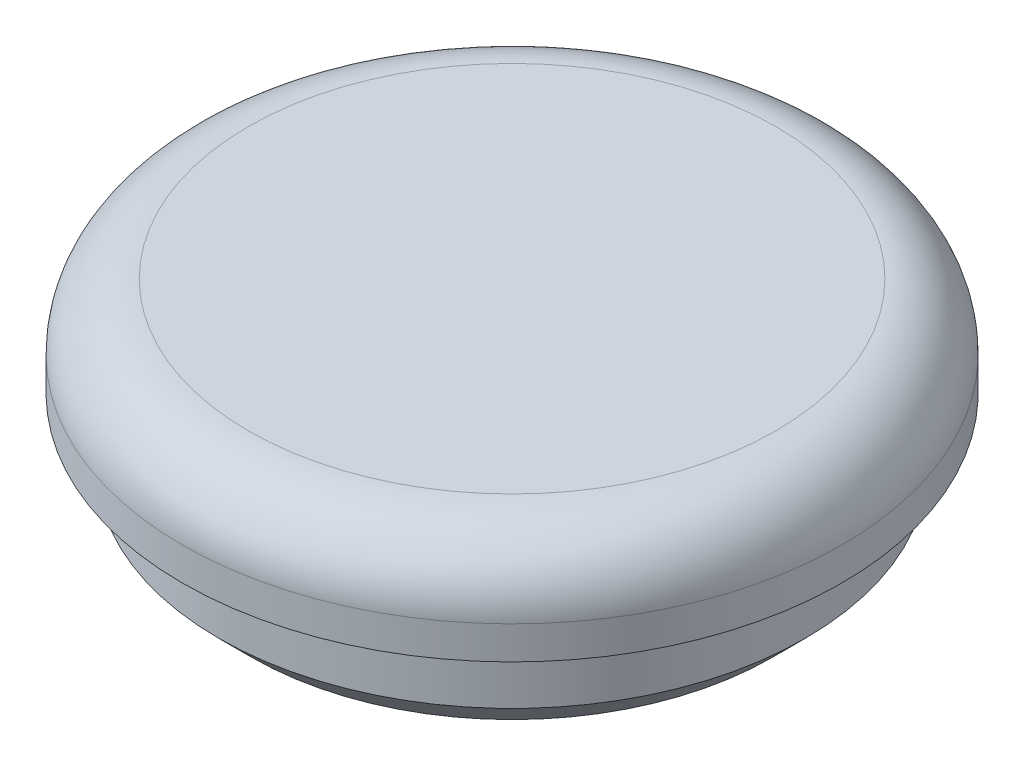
ISO-10303-21;
HEADER;
FILE_DESCRIPTION(('STEP AP214'),'2;1');
FILE_NAME('part.step','',(''),(''),'','','');
FILE_SCHEMA(('AUTOMOTIVE_DESIGN { 1 0 10303 214 1 1 1 1 }'));
ENDSEC;
DATA;
#1=APPLICATION_CONTEXT('core data for automotive mechanical design processes');
#2=APPLICATION_PROTOCOL_DEFINITION('international standard','automotive_design',2000,#1);
#3=PRODUCT_CONTEXT('',#1,'mechanical');
#4=PRODUCT('Part','Part','',(#3));
#5=PRODUCT_RELATED_PRODUCT_CATEGORY('part','',(#4));
#6=PRODUCT_DEFINITION_FORMATION('','',#4);
#7=PRODUCT_DEFINITION_CONTEXT('part definition',#1,'design');
#8=PRODUCT_DEFINITION('design','',#6,#7);
#9=PRODUCT_DEFINITION_SHAPE('','',#8);
#10=(LENGTH_UNIT() NAMED_UNIT(*) SI_UNIT(.MILLI.,.METRE.));
#11=(NAMED_UNIT(*) PLANE_ANGLE_UNIT() SI_UNIT($,.RADIAN.));
#12=(NAMED_UNIT(*) SI_UNIT($,.STERADIAN.) SOLID_ANGLE_UNIT());
#13=UNCERTAINTY_MEASURE_WITH_UNIT(LENGTH_MEASURE(1.E-05),#10,'distance_accuracy_value','');
#14=(GEOMETRIC_REPRESENTATION_CONTEXT(3) GLOBAL_UNCERTAINTY_ASSIGNED_CONTEXT((#13)) GLOBAL_UNIT_ASSIGNED_CONTEXT((#10,
#11,#12)) REPRESENTATION_CONTEXT('',''));
#15=CARTESIAN_POINT('',(0.,0.,0.));
#16=DIRECTION('',(0.,0.,1.));
#17=DIRECTION('',(1.,0.,0.));
#18=AXIS2_PLACEMENT_3D('',#15,#16,#17);
#19=CARTESIAN_POINT('',(0.,0.,0.));
#20=DIRECTION('',(0.,-1.,0.));
#21=DIRECTION('',(0.,0.,-1.));
#22=AXIS2_PLACEMENT_3D('',#19,#20,#21);
#23=PLANE('',#22);
#24=CARTESIAN_POINT('',(0.,0.,0.));
#25=DIRECTION('',(0.,1.,0.));
#26=DIRECTION('',(0.,0.,1.));
#27=AXIS2_PLACEMENT_3D('',#24,#25,#26);
#28=CIRCLE('',#27,3.99999999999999);
#29=CARTESIAN_POINT('',(0.,0.,3.99999999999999));
#30=VERTEX_POINT('',#29);
#31=EDGE_CURVE('E10',#30,#30,#28,.T.);
#32=ORIENTED_EDGE('',*,*,#31,.T.);
#33=EDGE_LOOP('',(#32));
#34=FACE_BOUND('',#33,.T.);
#35=ADVANCED_FACE('F43',(#34),#23,.F.);
#36=CARTESIAN_POINT('',(0.,-1.,0.));
#37=DIRECTION('',(0.,1.,0.));
#38=DIRECTION('',(0.,0.,1.));
#39=AXIS2_PLACEMENT_3D('',#36,#37,#38);
#40=TOROIDAL_SURFACE('',#39,4.,1.);
#41=ORIENTED_EDGE('',*,*,#31,.F.);
#42=EDGE_LOOP('',(#41));
#43=FACE_BOUND('',#42,.T.);
#44=CARTESIAN_POINT('',(0.,-1.00000000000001,0.));
#45=DIRECTION('',(0.,1.,0.));
#46=DIRECTION('',(0.,0.,1.));
#47=AXIS2_PLACEMENT_3D('',#44,#45,#46);
#48=CIRCLE('',#47,5.);
#49=CARTESIAN_POINT('',(0.,-1.00000000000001,5.));
#50=VERTEX_POINT('',#49);
#51=EDGE_CURVE('E50',#50,#50,#48,.T.);
#52=ORIENTED_EDGE('',*,*,#51,.T.);
#53=EDGE_LOOP('',(#52));
#54=FACE_BOUND('',#53,.T.);
#55=ADVANCED_FACE('F87',(#43,#54),#40,.T.);
#56=CARTESIAN_POINT('',(0.,5.03649635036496,0.));
#57=DIRECTION('',(0.,1.,0.));
#58=DIRECTION('',(0.,0.,1.));
#59=AXIS2_PLACEMENT_3D('',#56,#57,#58);
#60=CYLINDRICAL_SURFACE('',#59,5.);
#61=ORIENTED_EDGE('',*,*,#51,.F.);
#62=EDGE_LOOP('',(#61));
#63=FACE_BOUND('',#62,.T.);
#64=CARTESIAN_POINT('',(0.,-1.5,0.));
#65=DIRECTION('',(0.,1.,0.));
#66=DIRECTION('',(0.,0.,1.));
#67=AXIS2_PLACEMENT_3D('',#64,#65,#66);
#68=CIRCLE('',#67,5.);
#69=CARTESIAN_POINT('',(0.,-1.5,5.));
#70=VERTEX_POINT('',#69);
#71=EDGE_CURVE('E55',#70,#70,#68,.T.);
#72=ORIENTED_EDGE('',*,*,#71,.T.);
#73=EDGE_LOOP('',(#72));
#74=FACE_BOUND('',#73,.T.);
#75=ADVANCED_FACE('F91',(#63,#74),#60,.T.);
#76=CARTESIAN_POINT('',(5.,-1.5,0.));
#77=DIRECTION('',(0.,1.,0.));
#78=DIRECTION('',(0.,0.,1.));
#79=AXIS2_PLACEMENT_3D('',#76,#77,#78);
#80=PLANE('',#79);
#81=ORIENTED_EDGE('',*,*,#71,.F.);
#82=EDGE_LOOP('',(#81));
#83=FACE_BOUND('',#82,.T.);
#84=CARTESIAN_POINT('',(0.,-1.5,0.));
#85=DIRECTION('',(0.,1.,0.));
#86=DIRECTION('',(0.,0.,1.));
#87=AXIS2_PLACEMENT_3D('',#84,#85,#86);
#88=CIRCLE('',#87,4.45);
#89=CARTESIAN_POINT('',(0.,-1.5,4.45));
#90=VERTEX_POINT('',#89);
#91=EDGE_CURVE('E60',#90,#90,#88,.T.);
#92=ORIENTED_EDGE('',*,*,#91,.T.);
#93=EDGE_LOOP('',(#92));
#94=FACE_BOUND('',#93,.T.);
#95=ADVANCED_FACE('F96',(#83,#94),#80,.F.);
#96=CARTESIAN_POINT('',(0.,5.03649635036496,0.));
#97=DIRECTION('',(0.,1.,0.));
#98=DIRECTION('',(0.,0.,1.));
#99=AXIS2_PLACEMENT_3D('',#96,#97,#98);
#100=CYLINDRICAL_SURFACE('',#99,4.45);
#101=ORIENTED_EDGE('',*,*,#91,.F.);
#102=EDGE_LOOP('',(#101));
#103=FACE_BOUND('',#102,.T.);
#104=CARTESIAN_POINT('',(0.,-2.5,0.));
#105=DIRECTION('',(0.,1.,0.));
#106=DIRECTION('',(0.,0.,1.));
#107=AXIS2_PLACEMENT_3D('',#104,#105,#106);
#108=CIRCLE('',#107,4.45);
#109=CARTESIAN_POINT('',(0.,-2.5,4.45));
#110=VERTEX_POINT('',#109);
#111=EDGE_CURVE('E66',#110,#110,#108,.T.);
#112=ORIENTED_EDGE('',*,*,#111,.T.);
#113=EDGE_LOOP('',(#112));
#114=FACE_BOUND('',#113,.T.);
#115=ADVANCED_FACE('F83',(#103,#114),#100,.T.);
#116=CARTESIAN_POINT('',(0.,-3.,0.));
#117=DIRECTION('',(0.,1.,0.));
#118=DIRECTION('',(0.,0.,1.));
#119=AXIS2_PLACEMENT_3D('',#116,#117,#118);
#120=CONICAL_SURFACE('',#119,3.95,0.785398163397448);
#121=ORIENTED_EDGE('',*,*,#111,.F.);
#122=EDGE_LOOP('',(#121));
#123=FACE_BOUND('',#122,.T.);
#124=CARTESIAN_POINT('',(0.,-3.,0.));
#125=DIRECTION('',(0.,1.,0.));
#126=DIRECTION('',(0.,0.,1.));
#127=AXIS2_PLACEMENT_3D('',#124,#125,#126);
#128=CIRCLE('',#127,3.95);
#129=CARTESIAN_POINT('',(0.,-3.,3.95));
#130=VERTEX_POINT('',#129);
#131=EDGE_CURVE('E70',#130,#130,#128,.T.);
#132=ORIENTED_EDGE('',*,*,#131,.T.);
#133=EDGE_LOOP('',(#132));
#134=FACE_BOUND('',#133,.T.);
#135=ADVANCED_FACE('F75',(#123,#134),#120,.T.);
#136=CARTESIAN_POINT('',(3.95,-3.,0.));
#137=DIRECTION('',(0.,1.,0.));
#138=DIRECTION('',(0.,0.,1.));
#139=AXIS2_PLACEMENT_3D('',#136,#137,#138);
#140=PLANE('',#139);
#141=ORIENTED_EDGE('',*,*,#131,.F.);
#142=EDGE_LOOP('',(#141));
#143=FACE_BOUND('',#142,.T.);
#144=ADVANCED_FACE('F77',(#143),#140,.F.);
#145=CLOSED_SHELL('',(#35,#55,#75,#95,#115,#135,#144));
#146=MANIFOLD_SOLID_BREP('B2',#145);
#147=ADVANCED_BREP_SHAPE_REPRESENTATION('',(#18,#146),#14);
#148=SHAPE_DEFINITION_REPRESENTATION(#9,#147);
ENDSEC;
END-ISO-10303-21;
